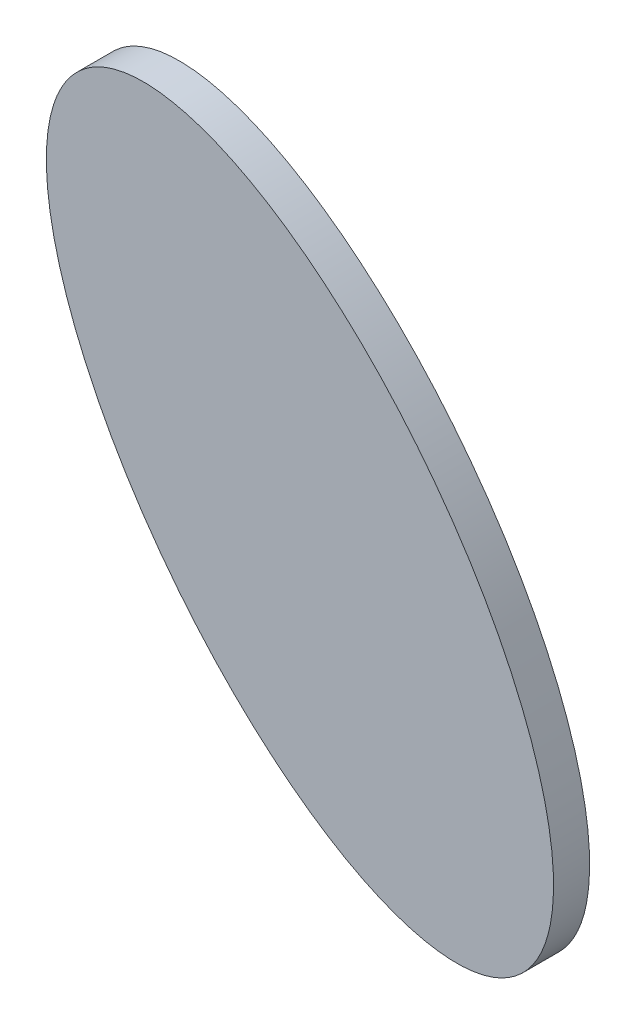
ISO-10303-21;
HEADER;
FILE_DESCRIPTION(('STEP AP214'),'2;1');
FILE_NAME('part.step','',(''),(''),'','','');
FILE_SCHEMA(('AUTOMOTIVE_DESIGN { 1 0 10303 214 1 1 1 1 }'));
ENDSEC;
DATA;
#1=APPLICATION_CONTEXT('core data for automotive mechanical design processes');
#2=APPLICATION_PROTOCOL_DEFINITION('international standard','automotive_design',2000,#1);
#3=PRODUCT_CONTEXT('',#1,'mechanical');
#4=PRODUCT('Part','Part','',(#3));
#5=PRODUCT_RELATED_PRODUCT_CATEGORY('part','',(#4));
#6=PRODUCT_DEFINITION_FORMATION('','',#4);
#7=PRODUCT_DEFINITION_CONTEXT('part definition',#1,'design');
#8=PRODUCT_DEFINITION('design','',#6,#7);
#9=PRODUCT_DEFINITION_SHAPE('','',#8);
#10=(LENGTH_UNIT() NAMED_UNIT(*) SI_UNIT(.MILLI.,.METRE.));
#11=(NAMED_UNIT(*) PLANE_ANGLE_UNIT() SI_UNIT($,.RADIAN.));
#12=(NAMED_UNIT(*) SI_UNIT($,.STERADIAN.) SOLID_ANGLE_UNIT());
#13=UNCERTAINTY_MEASURE_WITH_UNIT(LENGTH_MEASURE(1.E-05),#10,'distance_accuracy_value','');
#14=(GEOMETRIC_REPRESENTATION_CONTEXT(3) GLOBAL_UNCERTAINTY_ASSIGNED_CONTEXT((#13)) GLOBAL_UNIT_ASSIGNED_CONTEXT((#10,
#11,#12)) REPRESENTATION_CONTEXT('',''));
#15=CARTESIAN_POINT('',(0.,0.,0.));
#16=DIRECTION('',(0.,0.,1.));
#17=DIRECTION('',(1.,0.,0.));
#18=AXIS2_PLACEMENT_3D('',#15,#16,#17);
#19=CARTESIAN_POINT('',(0.,0.,80.));
#20=DIRECTION('',(0.,0.,1.));
#21=DIRECTION('',(-0.600105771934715,0.79992066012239,0.));
#22=AXIS2_PLACEMENT_3D('',#19,#20,#21);
#23=ELLIPSE('',#22,791.953541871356,375.);
#24=DIRECTION('',(0.,0.,-1.));
#25=VECTOR('',#24,1.);
#26=SURFACE_OF_LINEAR_EXTRUSION('',#23,#25);
#27=CARTESIAN_POINT('',(-475.255891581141,633.5,80.));
#28=VERTEX_POINT('',#27);
#29=EDGE_CURVE('E10',#28,#28,#23,.T.);
#30=ORIENTED_EDGE('',*,*,#29,.F.);
#31=EDGE_LOOP('',(#30));
#32=FACE_BOUND('',#31,.T.);
#33=CARTESIAN_POINT('',(0.,0.,0.));
#34=DIRECTION('',(0.,0.,1.));
#35=DIRECTION('',(-0.600105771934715,0.79992066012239,0.));
#36=AXIS2_PLACEMENT_3D('',#33,#34,#35);
#37=ELLIPSE('',#36,791.953541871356,375.);
#38=CARTESIAN_POINT('',(-475.255891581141,633.5,0.));
#39=VERTEX_POINT('',#38);
#40=EDGE_CURVE('E37',#39,#39,#37,.T.);
#41=ORIENTED_EDGE('',*,*,#40,.T.);
#42=EDGE_LOOP('',(#41));
#43=FACE_BOUND('',#42,.T.);
#44=ADVANCED_FACE('F33',(#32,#43),#26,.F.);
#45=CARTESIAN_POINT('',(0.,0.,80.));
#46=DIRECTION('',(0.,0.,1.));
#47=DIRECTION('',(1.,0.,0.));
#48=AXIS2_PLACEMENT_3D('',#45,#46,#47);
#49=PLANE('',#48);
#50=ORIENTED_EDGE('',*,*,#29,.T.);
#51=EDGE_LOOP('',(#50));
#52=FACE_BOUND('',#51,.T.);
#53=ADVANCED_FACE('F49',(#52),#49,.T.);
#54=CARTESIAN_POINT('',(0.,0.,0.));
#55=DIRECTION('',(0.,0.,1.));
#56=DIRECTION('',(1.,0.,0.));
#57=AXIS2_PLACEMENT_3D('',#54,#55,#56);
#58=PLANE('',#57);
#59=ORIENTED_EDGE('',*,*,#40,.F.);
#60=EDGE_LOOP('',(#59));
#61=FACE_BOUND('',#60,.T.);
#62=ADVANCED_FACE('F47',(#61),#58,.F.);
#63=CLOSED_SHELL('',(#44,#53,#62));
#64=MANIFOLD_SOLID_BREP('B2',#63);
#65=ADVANCED_BREP_SHAPE_REPRESENTATION('',(#18,#64),#14);
#66=SHAPE_DEFINITION_REPRESENTATION(#9,#65);
ENDSEC;
END-ISO-10303-21;
